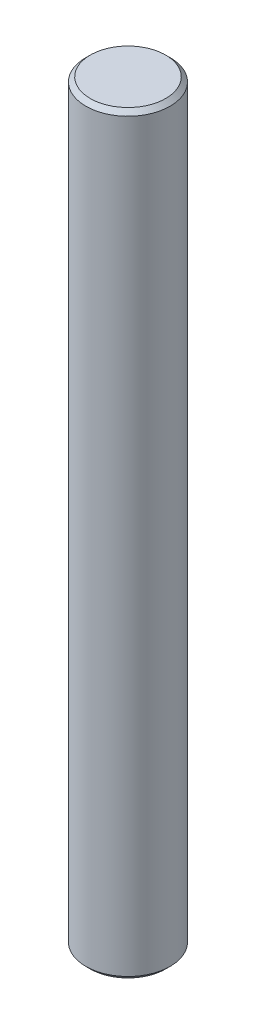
from build123d import *

# Parameters (mm, degrees)
SKETCH1_R      = 2.413
EXTRUDE1_DEPTH = 21.59
CHAMFER1_SIZE  = 0.254


with BuildPart() as part:
    # Sketch1 → Extrude1 (new, symmetric)
    with BuildSketch(Plane(origin=(0, 0, 0), x_dir=(1, 0, 0), z_dir=(0, 1, 0))):
        with Locations(Location((0, 0, 0), (0, 0, 270))):
            Circle(SKETCH1_R)
    extrude(amount=EXTRUDE1_DEPTH, both=True)

    # Chamfer1
    chamfer1_edges = [part.edges().sort_by_distance(p)[0] for p in [
        (0, -21.59, -2.413),
        (0, 21.59, -2.413),
    ]]
    chamfer(chamfer1_edges, length=CHAMFER1_SIZE)


solid = part.part
